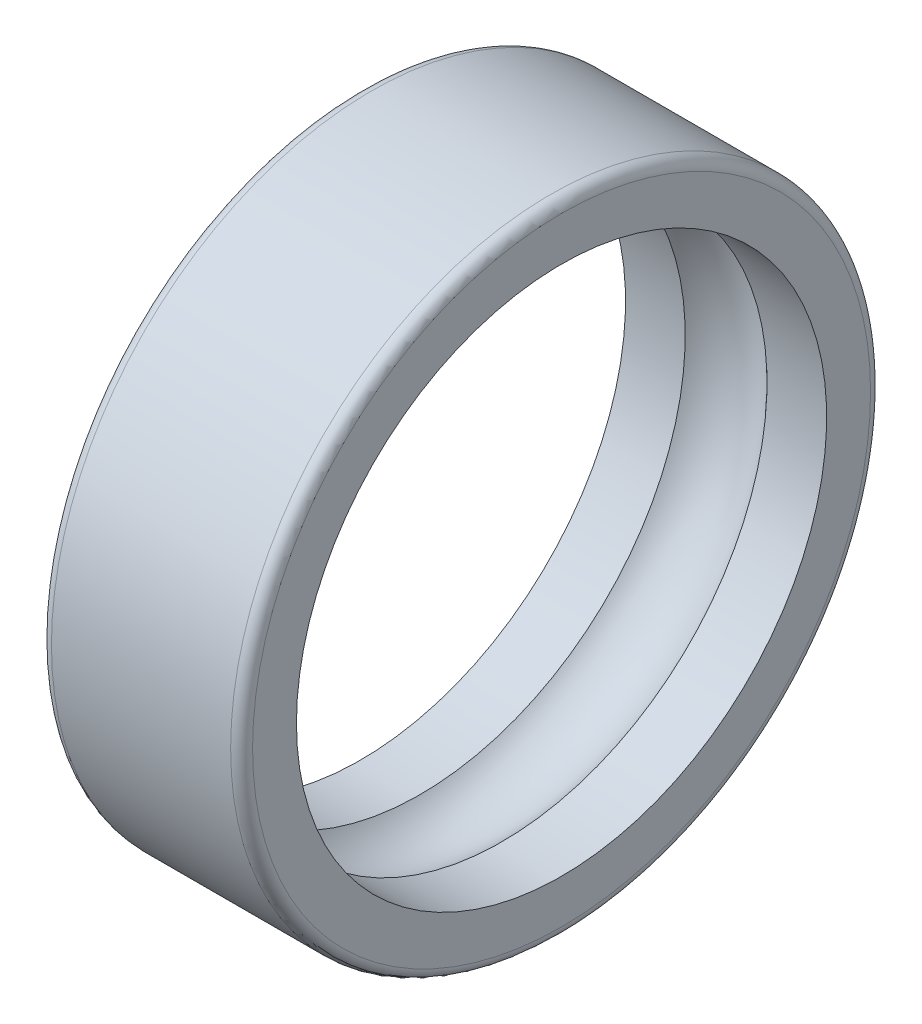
ISO-10303-21;
HEADER;
FILE_DESCRIPTION(('STEP AP214'),'2;1');
FILE_NAME('part.step','',(''),(''),'','','');
FILE_SCHEMA(('AUTOMOTIVE_DESIGN { 1 0 10303 214 1 1 1 1 }'));
ENDSEC;
DATA;
#1=APPLICATION_CONTEXT('core data for automotive mechanical design processes');
#2=APPLICATION_PROTOCOL_DEFINITION('international standard','automotive_design',2000,#1);
#3=PRODUCT_CONTEXT('',#1,'mechanical');
#4=PRODUCT('Part','Part','',(#3));
#5=PRODUCT_RELATED_PRODUCT_CATEGORY('part','',(#4));
#6=PRODUCT_DEFINITION_FORMATION('','',#4);
#7=PRODUCT_DEFINITION_CONTEXT('part definition',#1,'design');
#8=PRODUCT_DEFINITION('design','',#6,#7);
#9=PRODUCT_DEFINITION_SHAPE('','',#8);
#10=(LENGTH_UNIT() NAMED_UNIT(*) SI_UNIT(.MILLI.,.METRE.));
#11=(NAMED_UNIT(*) PLANE_ANGLE_UNIT() SI_UNIT($,.RADIAN.));
#12=(NAMED_UNIT(*) SI_UNIT($,.STERADIAN.) SOLID_ANGLE_UNIT());
#13=UNCERTAINTY_MEASURE_WITH_UNIT(LENGTH_MEASURE(1.E-05),#10,'distance_accuracy_value','');
#14=(GEOMETRIC_REPRESENTATION_CONTEXT(3) GLOBAL_UNCERTAINTY_ASSIGNED_CONTEXT((#13)) GLOBAL_UNIT_ASSIGNED_CONTEXT((#10,
#11,#12)) REPRESENTATION_CONTEXT('',''));
#15=CARTESIAN_POINT('',(0.,0.,0.));
#16=DIRECTION('',(0.,0.,1.));
#17=DIRECTION('',(1.,0.,0.));
#18=AXIS2_PLACEMENT_3D('',#15,#16,#17);
#19=CARTESIAN_POINT('',(0.6,0.,0.));
#20=DIRECTION('',(-1.,0.,0.));
#21=DIRECTION('',(0.,0.,1.));
#22=AXIS2_PLACEMENT_3D('',#19,#20,#21);
#23=TOROIDAL_SURFACE('',#22,16.9,0.6);
#24=CARTESIAN_POINT('',(0.,0.,0.));
#25=DIRECTION('',(-1.,0.,0.));
#26=DIRECTION('',(0.,0.,1.));
#27=AXIS2_PLACEMENT_3D('',#24,#25,#26);
#28=CIRCLE('',#27,16.9);
#29=CARTESIAN_POINT('',(0.,0.,16.9));
#30=VERTEX_POINT('',#29);
#31=EDGE_CURVE('E10',#30,#30,#28,.T.);
#32=ORIENTED_EDGE('',*,*,#31,.F.);
#33=EDGE_LOOP('',(#32));
#34=FACE_BOUND('',#33,.T.);
#35=CARTESIAN_POINT('',(0.6,0.,0.));
#36=DIRECTION('',(-1.,0.,0.));
#37=DIRECTION('',(0.,0.,1.));
#38=AXIS2_PLACEMENT_3D('',#35,#36,#37);
#39=CIRCLE('',#38,17.5);
#40=CARTESIAN_POINT('',(0.6,0.,17.5));
#41=VERTEX_POINT('',#40);
#42=EDGE_CURVE('E52',#41,#41,#39,.T.);
#43=ORIENTED_EDGE('',*,*,#42,.T.);
#44=EDGE_LOOP('',(#43));
#45=FACE_BOUND('',#44,.T.);
#46=ADVANCED_FACE('F24',(#34,#45),#23,.T.);
#47=CARTESIAN_POINT('',(0.,0.,-16.9));
#48=DIRECTION('',(1.,0.,0.));
#49=DIRECTION('',(0.,0.,-1.));
#50=AXIS2_PLACEMENT_3D('',#47,#48,#49);
#51=PLANE('',#50);
#52=CARTESIAN_POINT('',(0.,0.,0.));
#53=DIRECTION('',(-1.,0.,0.));
#54=DIRECTION('',(0.,0.,1.));
#55=AXIS2_PLACEMENT_3D('',#52,#53,#54);
#56=CIRCLE('',#55,14.5);
#57=CARTESIAN_POINT('',(0.,0.,14.5));
#58=VERTEX_POINT('',#57);
#59=EDGE_CURVE('E30',#58,#58,#56,.T.);
#60=ORIENTED_EDGE('',*,*,#59,.F.);
#61=EDGE_LOOP('',(#60));
#62=FACE_BOUND('',#61,.T.);
#63=ORIENTED_EDGE('',*,*,#31,.T.);
#64=EDGE_LOOP('',(#63));
#65=FACE_BOUND('',#64,.T.);
#66=ADVANCED_FACE('F89',(#62,#65),#51,.F.);
#67=CARTESIAN_POINT('',(0.,0.,0.));
#68=DIRECTION('',(-1.,0.,0.));
#69=DIRECTION('',(0.,0.,1.));
#70=AXIS2_PLACEMENT_3D('',#67,#68,#69);
#71=CYLINDRICAL_SURFACE('',#70,14.5);
#72=CARTESIAN_POINT('',(3.26393202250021,0.,0.));
#73=DIRECTION('',(-1.,0.,0.));
#74=DIRECTION('',(0.,0.,1.));
#75=AXIS2_PLACEMENT_3D('',#72,#73,#74);
#76=CIRCLE('',#75,14.5);
#77=CARTESIAN_POINT('',(3.26393202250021,0.,14.5));
#78=VERTEX_POINT('',#77);
#79=EDGE_CURVE('E34',#78,#78,#76,.T.);
#80=ORIENTED_EDGE('',*,*,#79,.F.);
#81=EDGE_LOOP('',(#80));
#82=FACE_BOUND('',#81,.T.);
#83=ORIENTED_EDGE('',*,*,#59,.T.);
#84=EDGE_LOOP('',(#83));
#85=FACE_BOUND('',#84,.T.);
#86=ADVANCED_FACE('F84',(#82,#85),#71,.F.);
#87=CARTESIAN_POINT('',(5.5,0.,0.));
#88=DIRECTION('',(-1.,0.,0.));
#89=DIRECTION('',(0.,0.,1.));
#90=AXIS2_PLACEMENT_3D('',#87,#88,#89);
#91=TOROIDAL_SURFACE('',#90,12.5,3.);
#92=CARTESIAN_POINT('',(7.73606797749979,0.,0.));
#93=DIRECTION('',(-1.,0.,0.));
#94=DIRECTION('',(0.,0.,1.));
#95=AXIS2_PLACEMENT_3D('',#92,#93,#94);
#96=CIRCLE('',#95,14.5);
#97=CARTESIAN_POINT('',(7.73606797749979,0.,14.5));
#98=VERTEX_POINT('',#97);
#99=EDGE_CURVE('E38',#98,#98,#96,.T.);
#100=ORIENTED_EDGE('',*,*,#99,.F.);
#101=EDGE_LOOP('',(#100));
#102=FACE_BOUND('',#101,.T.);
#103=ORIENTED_EDGE('',*,*,#79,.T.);
#104=EDGE_LOOP('',(#103));
#105=FACE_BOUND('',#104,.T.);
#106=ADVANCED_FACE('F78',(#102,#105),#91,.F.);
#107=CARTESIAN_POINT('',(0.,0.,0.));
#108=DIRECTION('',(-1.,0.,0.));
#109=DIRECTION('',(0.,0.,1.));
#110=AXIS2_PLACEMENT_3D('',#107,#108,#109);
#111=CYLINDRICAL_SURFACE('',#110,14.5);
#112=CARTESIAN_POINT('',(11.,0.,0.));
#113=DIRECTION('',(-1.,0.,0.));
#114=DIRECTION('',(0.,0.,1.));
#115=AXIS2_PLACEMENT_3D('',#112,#113,#114);
#116=CIRCLE('',#115,14.5);
#117=CARTESIAN_POINT('',(11.,0.,14.5));
#118=VERTEX_POINT('',#117);
#119=EDGE_CURVE('E43',#118,#118,#116,.T.);
#120=ORIENTED_EDGE('',*,*,#119,.F.);
#121=EDGE_LOOP('',(#120));
#122=FACE_BOUND('',#121,.T.);
#123=ORIENTED_EDGE('',*,*,#99,.T.);
#124=EDGE_LOOP('',(#123));
#125=FACE_BOUND('',#124,.T.);
#126=ADVANCED_FACE('F72',(#122,#125),#111,.F.);
#127=CARTESIAN_POINT('',(11.,0.,-16.9));
#128=DIRECTION('',(-1.,0.,0.));
#129=DIRECTION('',(0.,0.,1.));
#130=AXIS2_PLACEMENT_3D('',#127,#128,#129);
#131=PLANE('',#130);
#132=CARTESIAN_POINT('',(11.,0.,0.));
#133=DIRECTION('',(-1.,0.,0.));
#134=DIRECTION('',(0.,0.,1.));
#135=AXIS2_PLACEMENT_3D('',#132,#133,#134);
#136=CIRCLE('',#135,16.9);
#137=CARTESIAN_POINT('',(11.,0.,16.9));
#138=VERTEX_POINT('',#137);
#139=EDGE_CURVE('E46',#138,#138,#136,.T.);
#140=ORIENTED_EDGE('',*,*,#139,.F.);
#141=EDGE_LOOP('',(#140));
#142=FACE_BOUND('',#141,.T.);
#143=ORIENTED_EDGE('',*,*,#119,.T.);
#144=EDGE_LOOP('',(#143));
#145=FACE_BOUND('',#144,.T.);
#146=ADVANCED_FACE('F66',(#142,#145),#131,.F.);
#147=CARTESIAN_POINT('',(10.4,0.,0.));
#148=DIRECTION('',(-1.,0.,0.));
#149=DIRECTION('',(0.,0.,1.));
#150=AXIS2_PLACEMENT_3D('',#147,#148,#149);
#151=TOROIDAL_SURFACE('',#150,16.9,0.6);
#152=CARTESIAN_POINT('',(10.4,0.,0.));
#153=DIRECTION('',(-1.,0.,0.));
#154=DIRECTION('',(0.,0.,1.));
#155=AXIS2_PLACEMENT_3D('',#152,#153,#154);
#156=CIRCLE('',#155,17.5);
#157=CARTESIAN_POINT('',(10.4,0.,17.5));
#158=VERTEX_POINT('',#157);
#159=EDGE_CURVE('E49',#158,#158,#156,.T.);
#160=ORIENTED_EDGE('',*,*,#159,.F.);
#161=EDGE_LOOP('',(#160));
#162=FACE_BOUND('',#161,.T.);
#163=ORIENTED_EDGE('',*,*,#139,.T.);
#164=EDGE_LOOP('',(#163));
#165=FACE_BOUND('',#164,.T.);
#166=ADVANCED_FACE('F60',(#162,#165),#151,.T.);
#167=CARTESIAN_POINT('',(0.,0.,0.));
#168=DIRECTION('',(-1.,0.,0.));
#169=DIRECTION('',(0.,0.,1.));
#170=AXIS2_PLACEMENT_3D('',#167,#168,#169);
#171=CYLINDRICAL_SURFACE('',#170,17.5);
#172=ORIENTED_EDGE('',*,*,#42,.F.);
#173=EDGE_LOOP('',(#172));
#174=FACE_BOUND('',#173,.T.);
#175=ORIENTED_EDGE('',*,*,#159,.T.);
#176=EDGE_LOOP('',(#175));
#177=FACE_BOUND('',#176,.T.);
#178=ADVANCED_FACE('F57',(#174,#177),#171,.T.);
#179=CLOSED_SHELL('',(#46,#66,#86,#106,#126,#146,#166,#178));
#180=MANIFOLD_SOLID_BREP('B2',#179);
#181=ADVANCED_BREP_SHAPE_REPRESENTATION('',(#18,#180),#14);
#182=SHAPE_DEFINITION_REPRESENTATION(#9,#181);
ENDSEC;
END-ISO-10303-21;
